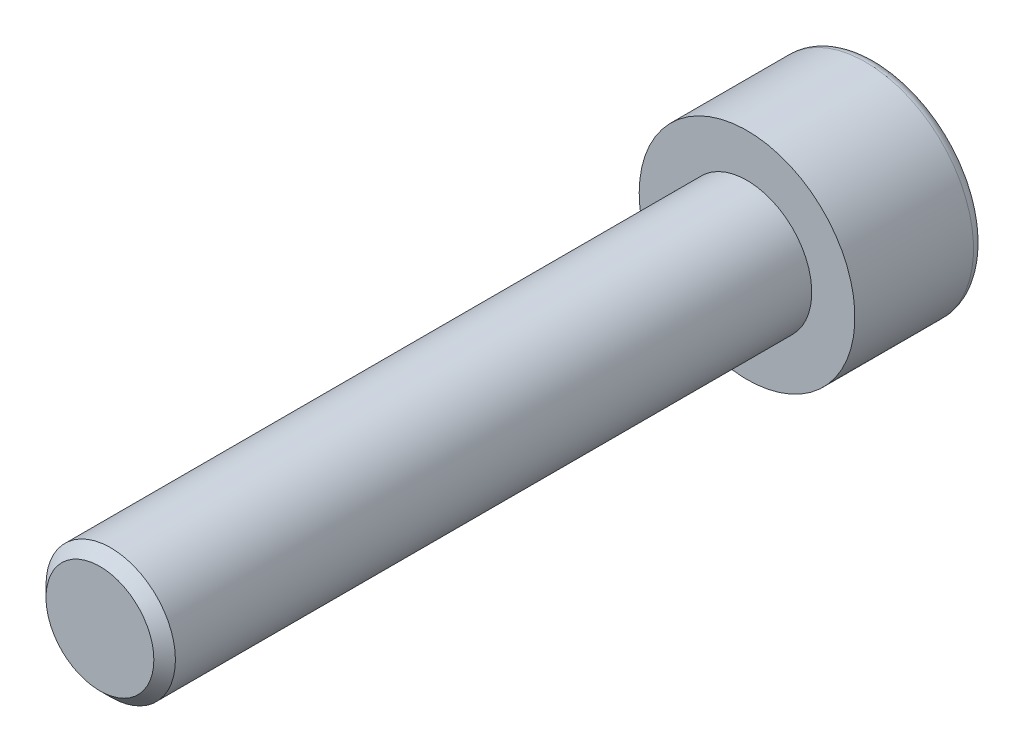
ISO-10303-21;
HEADER;
FILE_DESCRIPTION(('STEP AP214'),'2;1');
FILE_NAME('part.step','',(''),(''),'','','');
FILE_SCHEMA(('AUTOMOTIVE_DESIGN { 1 0 10303 214 1 1 1 1 }'));
ENDSEC;
DATA;
#1=APPLICATION_CONTEXT('core data for automotive mechanical design processes');
#2=APPLICATION_PROTOCOL_DEFINITION('international standard','automotive_design',2000,#1);
#3=PRODUCT_CONTEXT('',#1,'mechanical');
#4=PRODUCT('Part','Part','',(#3));
#5=PRODUCT_RELATED_PRODUCT_CATEGORY('part','',(#4));
#6=PRODUCT_DEFINITION_FORMATION('','',#4);
#7=PRODUCT_DEFINITION_CONTEXT('part definition',#1,'design');
#8=PRODUCT_DEFINITION('design','',#6,#7);
#9=PRODUCT_DEFINITION_SHAPE('','',#8);
#10=(LENGTH_UNIT() NAMED_UNIT(*) SI_UNIT(.MILLI.,.METRE.));
#11=(NAMED_UNIT(*) PLANE_ANGLE_UNIT() SI_UNIT($,.RADIAN.));
#12=(NAMED_UNIT(*) SI_UNIT($,.STERADIAN.) SOLID_ANGLE_UNIT());
#13=UNCERTAINTY_MEASURE_WITH_UNIT(LENGTH_MEASURE(1.E-05),#10,'distance_accuracy_value','');
#14=(GEOMETRIC_REPRESENTATION_CONTEXT(3) GLOBAL_UNCERTAINTY_ASSIGNED_CONTEXT((#13)) GLOBAL_UNIT_ASSIGNED_CONTEXT((#10,
#11,#12)) REPRESENTATION_CONTEXT('',''));
#15=CARTESIAN_POINT('',(0.,0.,0.));
#16=DIRECTION('',(0.,0.,1.));
#17=DIRECTION('',(1.,0.,0.));
#18=AXIS2_PLACEMENT_3D('',#15,#16,#17);
#19=CARTESIAN_POINT('',(0.,0.,30.));
#20=DIRECTION('',(0.,0.,-1.));
#21=DIRECTION('',(-1.,0.,0.));
#22=AXIS2_PLACEMENT_3D('',#19,#20,#21);
#23=CYLINDRICAL_SURFACE('',#22,3.);
#24=CARTESIAN_POINT('',(0.,0.,29.5));
#25=DIRECTION('',(0.,0.,1.));
#26=DIRECTION('',(1.,0.,0.));
#27=AXIS2_PLACEMENT_3D('',#24,#25,#26);
#28=CIRCLE('',#27,3.);
#29=CARTESIAN_POINT('',(3.,0.,29.5));
#30=VERTEX_POINT('',#29);
#31=EDGE_CURVE('E147',#30,#30,#28,.F.);
#32=ORIENTED_EDGE('',*,*,#31,.T.);
#33=EDGE_LOOP('',(#32));
#34=FACE_BOUND('',#33,.T.);
#35=CARTESIAN_POINT('',(0.,0.,0.));
#36=DIRECTION('',(0.,0.,-1.));
#37=DIRECTION('',(-1.,0.,0.));
#38=AXIS2_PLACEMENT_3D('',#35,#36,#37);
#39=CIRCLE('',#38,3.);
#40=CARTESIAN_POINT('',(-3.,0.,0.));
#41=VERTEX_POINT('',#40);
#42=EDGE_CURVE('E141',#41,#41,#39,.T.);
#43=ORIENTED_EDGE('',*,*,#42,.F.);
#44=EDGE_LOOP('',(#43));
#45=FACE_BOUND('',#44,.T.);
#46=ADVANCED_FACE('F31',(#34,#45),#23,.T.);
#47=CARTESIAN_POINT('',(0.,0.,30.));
#48=DIRECTION('',(0.,0.,1.));
#49=DIRECTION('',(1.,0.,0.));
#50=AXIS2_PLACEMENT_3D('',#47,#48,#49);
#51=PLANE('',#50);
#52=CARTESIAN_POINT('',(0.,0.,30.));
#53=DIRECTION('',(0.,0.,1.));
#54=DIRECTION('',(1.,0.,0.));
#55=AXIS2_PLACEMENT_3D('',#52,#53,#54);
#56=CIRCLE('',#55,2.5);
#57=CARTESIAN_POINT('',(2.5,0.,30.));
#58=VERTEX_POINT('',#57);
#59=EDGE_CURVE('E144',#58,#58,#56,.T.);
#60=ORIENTED_EDGE('',*,*,#59,.T.);
#61=EDGE_LOOP('',(#60));
#62=FACE_BOUND('',#61,.T.);
#63=ADVANCED_FACE('F168',(#62),#51,.T.);
#64=CARTESIAN_POINT('',(0.,0.,30.));
#65=DIRECTION('',(0.,0.,-1.));
#66=DIRECTION('',(-1.,0.,0.));
#67=AXIS2_PLACEMENT_3D('',#64,#65,#66);
#68=CONICAL_SURFACE('',#67,2.5,0.785398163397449);
#69=ORIENTED_EDGE('',*,*,#31,.F.);
#70=EDGE_LOOP('',(#69));
#71=FACE_BOUND('',#70,.T.);
#72=ORIENTED_EDGE('',*,*,#59,.F.);
#73=EDGE_LOOP('',(#72));
#74=FACE_BOUND('',#73,.T.);
#75=ADVANCED_FACE('F174',(#71,#74),#68,.T.);
#76=CARTESIAN_POINT('',(0.,0.,0.));
#77=DIRECTION('',(0.,0.,-1.));
#78=DIRECTION('',(-1.,0.,0.));
#79=AXIS2_PLACEMENT_3D('',#76,#77,#78);
#80=PLANE('',#79);
#81=CARTESIAN_POINT('',(0.,0.,0.));
#82=DIRECTION('',(0.,0.,-1.));
#83=DIRECTION('',(-1.,0.,0.));
#84=AXIS2_PLACEMENT_3D('',#81,#82,#83);
#85=CIRCLE('',#84,5.);
#86=CARTESIAN_POINT('',(-5.,0.,0.));
#87=VERTEX_POINT('',#86);
#88=EDGE_CURVE('E133',#87,#87,#85,.T.);
#89=ORIENTED_EDGE('',*,*,#88,.F.);
#90=EDGE_LOOP('',(#89));
#91=FACE_BOUND('',#90,.T.);
#92=ORIENTED_EDGE('',*,*,#42,.T.);
#93=EDGE_LOOP('',(#92));
#94=FACE_BOUND('',#93,.T.);
#95=ADVANCED_FACE('F180',(#91,#94),#80,.F.);
#96=CARTESIAN_POINT('',(0.,0.,-6.));
#97=DIRECTION('',(0.,0.,1.));
#98=DIRECTION('',(1.,0.,0.));
#99=AXIS2_PLACEMENT_3D('',#96,#97,#98);
#100=CYLINDRICAL_SURFACE('',#99,5.);
#101=CARTESIAN_POINT('',(0.,0.,-5.5));
#102=DIRECTION('',(0.,0.,-1.));
#103=DIRECTION('',(-1.,0.,0.));
#104=AXIS2_PLACEMENT_3D('',#101,#102,#103);
#105=CIRCLE('',#104,5.);
#106=CARTESIAN_POINT('',(-5.,0.,-5.5));
#107=VERTEX_POINT('',#106);
#108=EDGE_CURVE('E11',#107,#107,#105,.F.);
#109=ORIENTED_EDGE('',*,*,#108,.T.);
#110=EDGE_LOOP('',(#109));
#111=FACE_BOUND('',#110,.T.);
#112=ORIENTED_EDGE('',*,*,#88,.T.);
#113=EDGE_LOOP('',(#112));
#114=FACE_BOUND('',#113,.T.);
#115=ADVANCED_FACE('F163',(#111,#114),#100,.T.);
#116=CARTESIAN_POINT('',(0.,0.,-6.));
#117=DIRECTION('',(0.,0.,-1.));
#118=DIRECTION('',(-1.,0.,0.));
#119=AXIS2_PLACEMENT_3D('',#116,#117,#118);
#120=PLANE('',#119);
#121=DIRECTION('',(0.866025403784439,0.5,0.));
#122=VECTOR('',#121,1.);
#123=CARTESIAN_POINT('',(-2.5,1.44337567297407,-6.));
#124=LINE('',#123,#122);
#125=CARTESIAN_POINT('',(-2.5,1.44337567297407,-6.));
#126=VERTEX_POINT('',#125);
#127=CARTESIAN_POINT('',(0.,2.88675134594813,-6.));
#128=VERTEX_POINT('',#127);
#129=EDGE_CURVE('E46',#126,#128,#124,.T.);
#130=ORIENTED_EDGE('',*,*,#129,.F.);
#131=DIRECTION('',(0.,1.,0.));
#132=VECTOR('',#131,1.);
#133=CARTESIAN_POINT('',(-2.5,-1.44337567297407,-6.));
#134=LINE('',#133,#132);
#135=CARTESIAN_POINT('',(-2.5,-1.44337567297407,-6.));
#136=VERTEX_POINT('',#135);
#137=EDGE_CURVE('E129',#136,#126,#134,.T.);
#138=ORIENTED_EDGE('',*,*,#137,.F.);
#139=DIRECTION('',(-0.866025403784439,0.5,0.));
#140=VECTOR('',#139,1.);
#141=CARTESIAN_POINT('',(0.,-2.88675134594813,-6.));
#142=LINE('',#141,#140);
#143=CARTESIAN_POINT('',(0.,-2.88675134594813,-6.));
#144=VERTEX_POINT('',#143);
#145=EDGE_CURVE('E127',#144,#136,#142,.T.);
#146=ORIENTED_EDGE('',*,*,#145,.F.);
#147=DIRECTION('',(-0.866025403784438,-0.5,0.));
#148=VECTOR('',#147,1.);
#149=CARTESIAN_POINT('',(2.5,-1.44337567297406,-6.));
#150=LINE('',#149,#148);
#151=CARTESIAN_POINT('',(2.5,-1.44337567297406,-6.));
#152=VERTEX_POINT('',#151);
#153=EDGE_CURVE('E94',#152,#144,#150,.T.);
#154=ORIENTED_EDGE('',*,*,#153,.F.);
#155=DIRECTION('',(0.,-1.,0.));
#156=VECTOR('',#155,1.);
#157=CARTESIAN_POINT('',(2.5,1.44337567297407,-6.));
#158=LINE('',#157,#156);
#159=CARTESIAN_POINT('',(2.5,1.44337567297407,-6.));
#160=VERTEX_POINT('',#159);
#161=EDGE_CURVE('E123',#160,#152,#158,.T.);
#162=ORIENTED_EDGE('',*,*,#161,.F.);
#163=DIRECTION('',(0.866025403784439,-0.5,0.));
#164=VECTOR('',#163,1.);
#165=CARTESIAN_POINT('',(0.,2.88675134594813,-6.));
#166=LINE('',#165,#164);
#167=EDGE_CURVE('E120',#128,#160,#166,.T.);
#168=ORIENTED_EDGE('',*,*,#167,.F.);
#169=EDGE_LOOP('',(#130,#138,#146,#154,#162,#168));
#170=FACE_BOUND('',#169,.T.);
#171=CARTESIAN_POINT('',(0.,0.,-6.));
#172=DIRECTION('',(0.,0.,-1.));
#173=DIRECTION('',(-1.,0.,0.));
#174=AXIS2_PLACEMENT_3D('',#171,#172,#173);
#175=CIRCLE('',#174,4.5);
#176=CARTESIAN_POINT('',(-4.5,0.,-6.));
#177=VERTEX_POINT('',#176);
#178=EDGE_CURVE('E39',#177,#177,#175,.T.);
#179=ORIENTED_EDGE('',*,*,#178,.T.);
#180=EDGE_LOOP('',(#179));
#181=FACE_BOUND('',#180,.T.);
#182=ADVANCED_FACE('F152',(#170,#181),#120,.T.);
#183=CARTESIAN_POINT('',(0.,0.,-5.5));
#184=DIRECTION('',(0.,0.,-1.));
#185=DIRECTION('',(-1.,0.,0.));
#186=AXIS2_PLACEMENT_3D('',#183,#184,#185);
#187=TOROIDAL_SURFACE('',#186,4.5,0.5);
#188=ORIENTED_EDGE('',*,*,#108,.F.);
#189=EDGE_LOOP('',(#188));
#190=FACE_BOUND('',#189,.T.);
#191=ORIENTED_EDGE('',*,*,#178,.F.);
#192=EDGE_LOOP('',(#191));
#193=FACE_BOUND('',#192,.T.);
#194=ADVANCED_FACE('F33',(#190,#193),#187,.T.);
#195=CARTESIAN_POINT('',(-2.5,1.44337567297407,-2.));
#196=DIRECTION('',(-0.5,0.866025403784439,0.));
#197=DIRECTION('',(-0.866025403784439,-0.5,0.));
#198=AXIS2_PLACEMENT_3D('',#195,#196,#197);
#199=PLANE('',#198);
#200=ORIENTED_EDGE('',*,*,#129,.T.);
#201=DIRECTION('',(0.,0.,-1.));
#202=VECTOR('',#201,1.);
#203=CARTESIAN_POINT('',(0.,2.88675134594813,-2.));
#204=LINE('',#203,#202);
#205=CARTESIAN_POINT('',(0.,2.88675134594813,-2.));
#206=VERTEX_POINT('',#205);
#207=EDGE_CURVE('E76',#206,#128,#204,.T.);
#208=ORIENTED_EDGE('',*,*,#207,.F.);
#209=DIRECTION('',(0.866025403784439,0.5,0.));
#210=VECTOR('',#209,1.);
#211=CARTESIAN_POINT('',(-2.5,1.44337567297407,-2.));
#212=LINE('',#211,#210);
#213=CARTESIAN_POINT('',(-2.5,1.44337567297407,-2.));
#214=VERTEX_POINT('',#213);
#215=EDGE_CURVE('E131',#214,#206,#212,.T.);
#216=ORIENTED_EDGE('',*,*,#215,.F.);
#217=DIRECTION('',(0.,0.,-1.));
#218=VECTOR('',#217,1.);
#219=CARTESIAN_POINT('',(-2.5,1.44337567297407,-2.));
#220=LINE('',#219,#218);
#221=EDGE_CURVE('E54',#214,#126,#220,.T.);
#222=ORIENTED_EDGE('',*,*,#221,.T.);
#223=EDGE_LOOP('',(#200,#208,#216,#222));
#224=FACE_BOUND('',#223,.T.);
#225=ADVANCED_FACE('F155',(#224),#199,.F.);
#226=CARTESIAN_POINT('',(-2.5,-1.44337567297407,-2.));
#227=DIRECTION('',(-1.,0.,0.));
#228=DIRECTION('',(0.,-1.,0.));
#229=AXIS2_PLACEMENT_3D('',#226,#227,#228);
#230=PLANE('',#229);
#231=ORIENTED_EDGE('',*,*,#137,.T.);
#232=ORIENTED_EDGE('',*,*,#221,.F.);
#233=DIRECTION('',(0.,1.,0.));
#234=VECTOR('',#233,1.);
#235=CARTESIAN_POINT('',(-2.5,-1.44337567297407,-2.));
#236=LINE('',#235,#234);
#237=CARTESIAN_POINT('',(-2.5,-1.44337567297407,-2.));
#238=VERTEX_POINT('',#237);
#239=EDGE_CURVE('E106',#238,#214,#236,.T.);
#240=ORIENTED_EDGE('',*,*,#239,.F.);
#241=DIRECTION('',(0.,0.,-1.));
#242=VECTOR('',#241,1.);
#243=CARTESIAN_POINT('',(-2.5,-1.44337567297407,-2.));
#244=LINE('',#243,#242);
#245=EDGE_CURVE('E98',#238,#136,#244,.T.);
#246=ORIENTED_EDGE('',*,*,#245,.T.);
#247=EDGE_LOOP('',(#231,#232,#240,#246));
#248=FACE_BOUND('',#247,.T.);
#249=ADVANCED_FACE('F161',(#248),#230,.F.);
#250=CARTESIAN_POINT('',(0.,-2.88675134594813,-2.));
#251=DIRECTION('',(-0.5,-0.866025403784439,0.));
#252=DIRECTION('',(0.866025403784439,-0.5,0.));
#253=AXIS2_PLACEMENT_3D('',#250,#251,#252);
#254=PLANE('',#253);
#255=ORIENTED_EDGE('',*,*,#145,.T.);
#256=ORIENTED_EDGE('',*,*,#245,.F.);
#257=DIRECTION('',(-0.866025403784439,0.5,0.));
#258=VECTOR('',#257,1.);
#259=CARTESIAN_POINT('',(0.,-2.88675134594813,-2.));
#260=LINE('',#259,#258);
#261=CARTESIAN_POINT('',(0.,-2.88675134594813,-2.));
#262=VERTEX_POINT('',#261);
#263=EDGE_CURVE('E102',#262,#238,#260,.T.);
#264=ORIENTED_EDGE('',*,*,#263,.F.);
#265=DIRECTION('',(0.,0.,-1.));
#266=VECTOR('',#265,1.);
#267=CARTESIAN_POINT('',(0.,-2.88675134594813,-2.));
#268=LINE('',#267,#266);
#269=EDGE_CURVE('E87',#262,#144,#268,.T.);
#270=ORIENTED_EDGE('',*,*,#269,.T.);
#271=EDGE_LOOP('',(#255,#256,#264,#270));
#272=FACE_BOUND('',#271,.T.);
#273=ADVANCED_FACE('F103',(#272),#254,.F.);
#274=CARTESIAN_POINT('',(2.5,-1.44337567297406,-2.));
#275=DIRECTION('',(0.5,-0.866025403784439,0.));
#276=DIRECTION('',(0.866025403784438,0.5,0.));
#277=AXIS2_PLACEMENT_3D('',#274,#275,#276);
#278=PLANE('',#277);
#279=ORIENTED_EDGE('',*,*,#153,.T.);
#280=ORIENTED_EDGE('',*,*,#269,.F.);
#281=DIRECTION('',(-0.866025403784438,-0.5,0.));
#282=VECTOR('',#281,1.);
#283=CARTESIAN_POINT('',(2.5,-1.44337567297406,-2.));
#284=LINE('',#283,#282);
#285=CARTESIAN_POINT('',(2.5,-1.44337567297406,-2.));
#286=VERTEX_POINT('',#285);
#287=EDGE_CURVE('E91',#286,#262,#284,.T.);
#288=ORIENTED_EDGE('',*,*,#287,.F.);
#289=DIRECTION('',(0.,0.,-1.));
#290=VECTOR('',#289,1.);
#291=CARTESIAN_POINT('',(2.5,-1.44337567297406,-2.));
#292=LINE('',#291,#290);
#293=EDGE_CURVE('E99',#286,#152,#292,.T.);
#294=ORIENTED_EDGE('',*,*,#293,.T.);
#295=EDGE_LOOP('',(#279,#280,#288,#294));
#296=FACE_BOUND('',#295,.T.);
#297=ADVANCED_FACE('F89',(#296),#278,.F.);
#298=CARTESIAN_POINT('',(2.5,1.44337567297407,-2.));
#299=DIRECTION('',(1.,0.,0.));
#300=DIRECTION('',(0.,0.,-1.));
#301=AXIS2_PLACEMENT_3D('',#298,#299,#300);
#302=PLANE('',#301);
#303=ORIENTED_EDGE('',*,*,#161,.T.);
#304=ORIENTED_EDGE('',*,*,#293,.F.);
#305=DIRECTION('',(0.,-1.,0.));
#306=VECTOR('',#305,1.);
#307=CARTESIAN_POINT('',(2.5,1.44337567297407,-2.));
#308=LINE('',#307,#306);
#309=CARTESIAN_POINT('',(2.5,1.44337567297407,-2.));
#310=VERTEX_POINT('',#309);
#311=EDGE_CURVE('E112',#310,#286,#308,.T.);
#312=ORIENTED_EDGE('',*,*,#311,.F.);
#313=DIRECTION('',(0.,0.,-1.));
#314=VECTOR('',#313,1.);
#315=CARTESIAN_POINT('',(2.5,1.44337567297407,-2.));
#316=LINE('',#315,#314);
#317=EDGE_CURVE('E136',#310,#160,#316,.T.);
#318=ORIENTED_EDGE('',*,*,#317,.T.);
#319=EDGE_LOOP('',(#303,#304,#312,#318));
#320=FACE_BOUND('',#319,.T.);
#321=ADVANCED_FACE('F200',(#320),#302,.F.);
#322=CARTESIAN_POINT('',(0.,2.88675134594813,-2.));
#323=DIRECTION('',(0.5,0.866025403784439,0.));
#324=DIRECTION('',(-0.866025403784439,0.5,0.));
#325=AXIS2_PLACEMENT_3D('',#322,#323,#324);
#326=PLANE('',#325);
#327=ORIENTED_EDGE('',*,*,#167,.T.);
#328=ORIENTED_EDGE('',*,*,#317,.F.);
#329=DIRECTION('',(0.866025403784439,-0.5,0.));
#330=VECTOR('',#329,1.);
#331=CARTESIAN_POINT('',(0.,2.88675134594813,-2.));
#332=LINE('',#331,#330);
#333=EDGE_CURVE('E114',#206,#310,#332,.T.);
#334=ORIENTED_EDGE('',*,*,#333,.F.);
#335=ORIENTED_EDGE('',*,*,#207,.T.);
#336=EDGE_LOOP('',(#327,#328,#334,#335));
#337=FACE_BOUND('',#336,.T.);
#338=ADVANCED_FACE('F197',(#337),#326,.F.);
#339=CARTESIAN_POINT('',(-2.5,1.44337567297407,-2.));
#340=DIRECTION('',(0.,0.,1.));
#341=DIRECTION('',(1.,0.,0.));
#342=AXIS2_PLACEMENT_3D('',#339,#340,#341);
#343=PLANE('',#342);
#344=ORIENTED_EDGE('',*,*,#215,.T.);
#345=ORIENTED_EDGE('',*,*,#333,.T.);
#346=ORIENTED_EDGE('',*,*,#311,.T.);
#347=ORIENTED_EDGE('',*,*,#287,.T.);
#348=ORIENTED_EDGE('',*,*,#263,.T.);
#349=ORIENTED_EDGE('',*,*,#239,.T.);
#350=EDGE_LOOP('',(#344,#345,#346,#347,#348,#349));
#351=FACE_BOUND('',#350,.T.);
#352=ADVANCED_FACE('F109',(#351),#343,.F.);
#353=CLOSED_SHELL('',(#46,#63,#75,#95,#115,#182,#194,#225,#249,#273,#297,#321,#338,#352));
#354=MANIFOLD_SOLID_BREP('B2',#353);
#355=ADVANCED_BREP_SHAPE_REPRESENTATION('',(#18,#354),#14);
#356=SHAPE_DEFINITION_REPRESENTATION(#9,#355);
ENDSEC;
END-ISO-10303-21;
